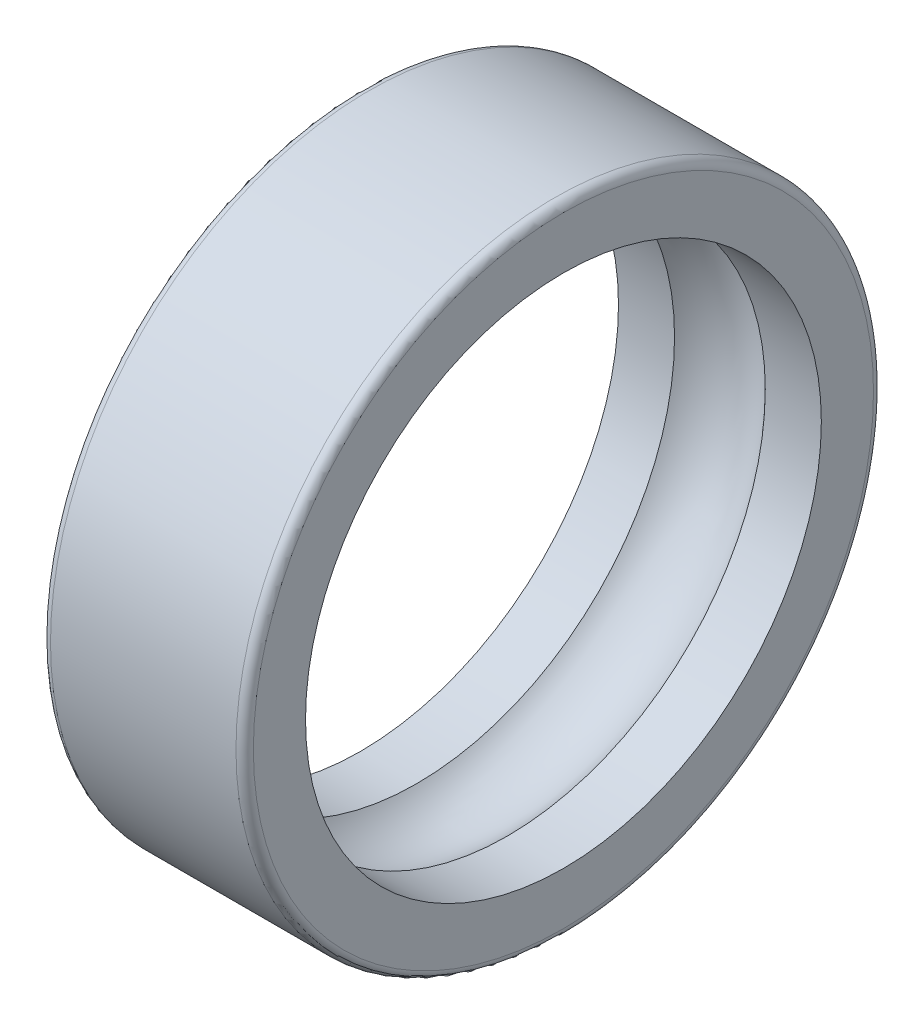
ISO-10303-21;
HEADER;
FILE_DESCRIPTION(('STEP AP214'),'2;1');
FILE_NAME('part.step','',(''),(''),'','','');
FILE_SCHEMA(('AUTOMOTIVE_DESIGN { 1 0 10303 214 1 1 1 1 }'));
ENDSEC;
DATA;
#1=APPLICATION_CONTEXT('core data for automotive mechanical design processes');
#2=APPLICATION_PROTOCOL_DEFINITION('international standard','automotive_design',2000,#1);
#3=PRODUCT_CONTEXT('',#1,'mechanical');
#4=PRODUCT('Part','Part','',(#3));
#5=PRODUCT_RELATED_PRODUCT_CATEGORY('part','',(#4));
#6=PRODUCT_DEFINITION_FORMATION('','',#4);
#7=PRODUCT_DEFINITION_CONTEXT('part definition',#1,'design');
#8=PRODUCT_DEFINITION('design','',#6,#7);
#9=PRODUCT_DEFINITION_SHAPE('','',#8);
#10=(LENGTH_UNIT() NAMED_UNIT(*) SI_UNIT(.MILLI.,.METRE.));
#11=(NAMED_UNIT(*) PLANE_ANGLE_UNIT() SI_UNIT($,.RADIAN.));
#12=(NAMED_UNIT(*) SI_UNIT($,.STERADIAN.) SOLID_ANGLE_UNIT());
#13=UNCERTAINTY_MEASURE_WITH_UNIT(LENGTH_MEASURE(1.E-05),#10,'distance_accuracy_value','');
#14=(GEOMETRIC_REPRESENTATION_CONTEXT(3) GLOBAL_UNCERTAINTY_ASSIGNED_CONTEXT((#13)) GLOBAL_UNIT_ASSIGNED_CONTEXT((#10,
#11,#12)) REPRESENTATION_CONTEXT('',''));
#15=CARTESIAN_POINT('',(0.,0.,0.));
#16=DIRECTION('',(0.,0.,1.));
#17=DIRECTION('',(1.,0.,0.));
#18=AXIS2_PLACEMENT_3D('',#15,#16,#17);
#19=CARTESIAN_POINT('',(0.300000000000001,0.,0.));
#20=DIRECTION('',(-1.,0.,0.));
#21=DIRECTION('',(0.,0.,1.));
#22=AXIS2_PLACEMENT_3D('',#19,#20,#21);
#23=TOROIDAL_SURFACE('',#22,10.7,0.3);
#24=CARTESIAN_POINT('',(0.,0.,0.));
#25=DIRECTION('',(-1.,0.,0.));
#26=DIRECTION('',(0.,0.,1.));
#27=AXIS2_PLACEMENT_3D('',#24,#25,#26);
#28=CIRCLE('',#27,10.7);
#29=CARTESIAN_POINT('',(0.,0.,10.7));
#30=VERTEX_POINT('',#29);
#31=EDGE_CURVE('E10',#30,#30,#28,.T.);
#32=ORIENTED_EDGE('',*,*,#31,.F.);
#33=EDGE_LOOP('',(#32));
#34=FACE_BOUND('',#33,.T.);
#35=CARTESIAN_POINT('',(0.300000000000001,0.,0.));
#36=DIRECTION('',(-1.,0.,0.));
#37=DIRECTION('',(0.,0.,1.));
#38=AXIS2_PLACEMENT_3D('',#35,#36,#37);
#39=CIRCLE('',#38,11.);
#40=CARTESIAN_POINT('',(0.300000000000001,0.,11.));
#41=VERTEX_POINT('',#40);
#42=EDGE_CURVE('E60',#41,#41,#39,.T.);
#43=ORIENTED_EDGE('',*,*,#42,.T.);
#44=EDGE_LOOP('',(#43));
#45=FACE_BOUND('',#44,.T.);
#46=ADVANCED_FACE('F32',(#34,#45),#23,.T.);
#47=CARTESIAN_POINT('',(0.,0.,-10.7));
#48=DIRECTION('',(1.,0.,0.));
#49=DIRECTION('',(0.,0.,-1.));
#50=AXIS2_PLACEMENT_3D('',#47,#48,#49);
#51=PLANE('',#50);
#52=CARTESIAN_POINT('',(0.,0.,0.));
#53=DIRECTION('',(-1.,0.,0.));
#54=DIRECTION('',(0.,0.,1.));
#55=AXIS2_PLACEMENT_3D('',#52,#53,#54);
#56=CIRCLE('',#55,8.9);
#57=CARTESIAN_POINT('',(0.,0.,8.9));
#58=VERTEX_POINT('',#57);
#59=EDGE_CURVE('E38',#58,#58,#56,.T.);
#60=ORIENTED_EDGE('',*,*,#59,.F.);
#61=EDGE_LOOP('',(#60));
#62=FACE_BOUND('',#61,.T.);
#63=ORIENTED_EDGE('',*,*,#31,.T.);
#64=EDGE_LOOP('',(#63));
#65=FACE_BOUND('',#64,.T.);
#66=ADVANCED_FACE('F97',(#62,#65),#51,.F.);
#67=CARTESIAN_POINT('',(0.,0.,0.));
#68=DIRECTION('',(-1.,0.,0.));
#69=DIRECTION('',(0.,0.,1.));
#70=AXIS2_PLACEMENT_3D('',#67,#68,#69);
#71=CYLINDRICAL_SURFACE('',#70,8.9);
#72=CARTESIAN_POINT('',(1.93475241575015,0.,0.));
#73=DIRECTION('',(-1.,0.,0.));
#74=DIRECTION('',(0.,0.,1.));
#75=AXIS2_PLACEMENT_3D('',#72,#73,#74);
#76=CIRCLE('',#75,8.9);
#77=CARTESIAN_POINT('',(1.93475241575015,0.,8.9));
#78=VERTEX_POINT('',#77);
#79=EDGE_CURVE('E42',#78,#78,#76,.T.);
#80=ORIENTED_EDGE('',*,*,#79,.F.);
#81=EDGE_LOOP('',(#80));
#82=FACE_BOUND('',#81,.T.);
#83=ORIENTED_EDGE('',*,*,#59,.T.);
#84=EDGE_LOOP('',(#83));
#85=FACE_BOUND('',#84,.T.);
#86=ADVANCED_FACE('F92',(#82,#85),#71,.F.);
#87=CARTESIAN_POINT('',(3.5,0.,0.));
#88=DIRECTION('',(-1.,0.,0.));
#89=DIRECTION('',(0.,0.,1.));
#90=AXIS2_PLACEMENT_3D('',#87,#88,#89);
#91=TOROIDAL_SURFACE('',#90,7.5,2.1);
#92=CARTESIAN_POINT('',(5.06524758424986,0.,0.));
#93=DIRECTION('',(-1.,0.,0.));
#94=DIRECTION('',(0.,0.,1.));
#95=AXIS2_PLACEMENT_3D('',#92,#93,#94);
#96=CIRCLE('',#95,8.9);
#97=CARTESIAN_POINT('',(5.06524758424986,0.,8.9));
#98=VERTEX_POINT('',#97);
#99=EDGE_CURVE('E46',#98,#98,#96,.T.);
#100=ORIENTED_EDGE('',*,*,#99,.F.);
#101=EDGE_LOOP('',(#100));
#102=FACE_BOUND('',#101,.T.);
#103=ORIENTED_EDGE('',*,*,#79,.T.);
#104=EDGE_LOOP('',(#103));
#105=FACE_BOUND('',#104,.T.);
#106=ADVANCED_FACE('F86',(#102,#105),#91,.F.);
#107=CARTESIAN_POINT('',(0.,0.,0.));
#108=DIRECTION('',(-1.,0.,0.));
#109=DIRECTION('',(0.,0.,1.));
#110=AXIS2_PLACEMENT_3D('',#107,#108,#109);
#111=CYLINDRICAL_SURFACE('',#110,8.9);
#112=CARTESIAN_POINT('',(7.,0.,0.));
#113=DIRECTION('',(-1.,0.,0.));
#114=DIRECTION('',(0.,0.,1.));
#115=AXIS2_PLACEMENT_3D('',#112,#113,#114);
#116=CIRCLE('',#115,8.9);
#117=CARTESIAN_POINT('',(7.,0.,8.9));
#118=VERTEX_POINT('',#117);
#119=EDGE_CURVE('E51',#118,#118,#116,.T.);
#120=ORIENTED_EDGE('',*,*,#119,.F.);
#121=EDGE_LOOP('',(#120));
#122=FACE_BOUND('',#121,.T.);
#123=ORIENTED_EDGE('',*,*,#99,.T.);
#124=EDGE_LOOP('',(#123));
#125=FACE_BOUND('',#124,.T.);
#126=ADVANCED_FACE('F80',(#122,#125),#111,.F.);
#127=CARTESIAN_POINT('',(7.,0.,-10.7));
#128=DIRECTION('',(-1.,0.,0.));
#129=DIRECTION('',(0.,0.,1.));
#130=AXIS2_PLACEMENT_3D('',#127,#128,#129);
#131=PLANE('',#130);
#132=CARTESIAN_POINT('',(7.,0.,0.));
#133=DIRECTION('',(-1.,0.,0.));
#134=DIRECTION('',(0.,0.,1.));
#135=AXIS2_PLACEMENT_3D('',#132,#133,#134);
#136=CIRCLE('',#135,10.7);
#137=CARTESIAN_POINT('',(7.,0.,10.7));
#138=VERTEX_POINT('',#137);
#139=EDGE_CURVE('E54',#138,#138,#136,.T.);
#140=ORIENTED_EDGE('',*,*,#139,.F.);
#141=EDGE_LOOP('',(#140));
#142=FACE_BOUND('',#141,.T.);
#143=ORIENTED_EDGE('',*,*,#119,.T.);
#144=EDGE_LOOP('',(#143));
#145=FACE_BOUND('',#144,.T.);
#146=ADVANCED_FACE('F74',(#142,#145),#131,.F.);
#147=CARTESIAN_POINT('',(6.7,0.,0.));
#148=DIRECTION('',(-1.,0.,0.));
#149=DIRECTION('',(0.,0.,1.));
#150=AXIS2_PLACEMENT_3D('',#147,#148,#149);
#151=TOROIDAL_SURFACE('',#150,10.7,0.3);
#152=CARTESIAN_POINT('',(6.7,0.,0.));
#153=DIRECTION('',(-1.,0.,0.));
#154=DIRECTION('',(0.,0.,1.));
#155=AXIS2_PLACEMENT_3D('',#152,#153,#154);
#156=CIRCLE('',#155,11.);
#157=CARTESIAN_POINT('',(6.7,0.,11.));
#158=VERTEX_POINT('',#157);
#159=EDGE_CURVE('E57',#158,#158,#156,.T.);
#160=ORIENTED_EDGE('',*,*,#159,.F.);
#161=EDGE_LOOP('',(#160));
#162=FACE_BOUND('',#161,.T.);
#163=ORIENTED_EDGE('',*,*,#139,.T.);
#164=EDGE_LOOP('',(#163));
#165=FACE_BOUND('',#164,.T.);
#166=ADVANCED_FACE('F68',(#162,#165),#151,.T.);
#167=CARTESIAN_POINT('',(0.,0.,0.));
#168=DIRECTION('',(-1.,0.,0.));
#169=DIRECTION('',(0.,0.,1.));
#170=AXIS2_PLACEMENT_3D('',#167,#168,#169);
#171=CYLINDRICAL_SURFACE('',#170,11.);
#172=ORIENTED_EDGE('',*,*,#42,.F.);
#173=EDGE_LOOP('',(#172));
#174=FACE_BOUND('',#173,.T.);
#175=ORIENTED_EDGE('',*,*,#159,.T.);
#176=EDGE_LOOP('',(#175));
#177=FACE_BOUND('',#176,.T.);
#178=ADVANCED_FACE('F65',(#174,#177),#171,.T.);
#179=CLOSED_SHELL('',(#46,#66,#86,#106,#126,#146,#166,#178));
#180=MANIFOLD_SOLID_BREP('B2',#179);
#181=ADVANCED_BREP_SHAPE_REPRESENTATION('',(#18,#180),#14);
#182=SHAPE_DEFINITION_REPRESENTATION(#9,#181);
ENDSEC;
END-ISO-10303-21;
